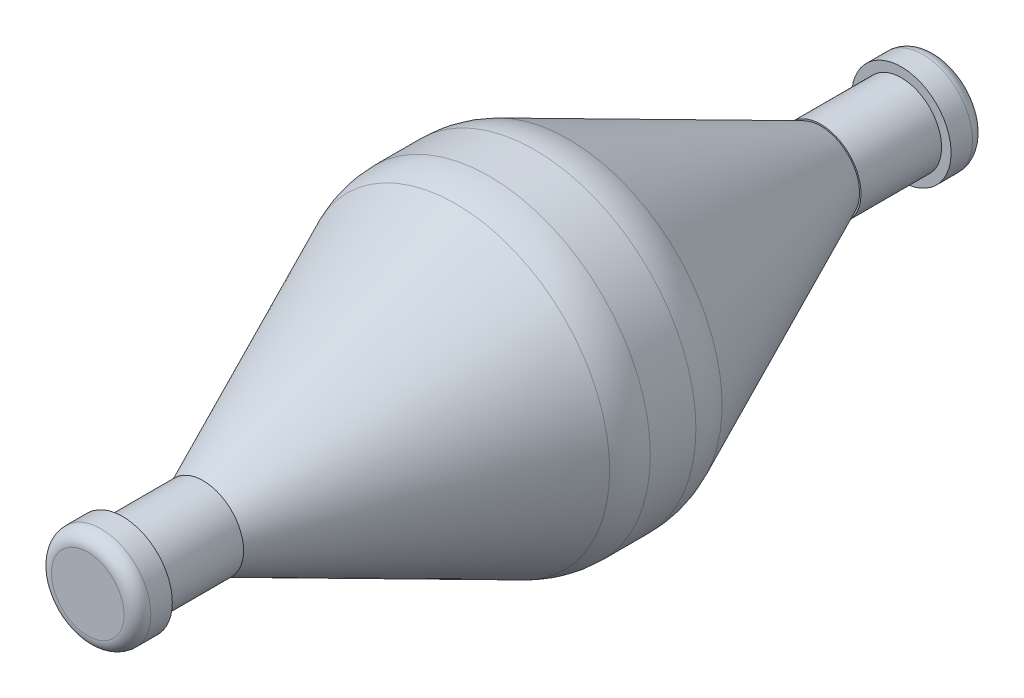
ISO-10303-21;
HEADER;
FILE_DESCRIPTION(('STEP AP214'),'2;1');
FILE_NAME('part.step','',(''),(''),'','','');
FILE_SCHEMA(('AUTOMOTIVE_DESIGN { 1 0 10303 214 1 1 1 1 }'));
ENDSEC;
DATA;
#1=APPLICATION_CONTEXT('core data for automotive mechanical design processes');
#2=APPLICATION_PROTOCOL_DEFINITION('international standard','automotive_design',2000,#1);
#3=PRODUCT_CONTEXT('',#1,'mechanical');
#4=PRODUCT('Part','Part','',(#3));
#5=PRODUCT_RELATED_PRODUCT_CATEGORY('part','',(#4));
#6=PRODUCT_DEFINITION_FORMATION('','',#4);
#7=PRODUCT_DEFINITION_CONTEXT('part definition',#1,'design');
#8=PRODUCT_DEFINITION('design','',#6,#7);
#9=PRODUCT_DEFINITION_SHAPE('','',#8);
#10=(LENGTH_UNIT() NAMED_UNIT(*) SI_UNIT(.MILLI.,.METRE.));
#11=(NAMED_UNIT(*) PLANE_ANGLE_UNIT() SI_UNIT($,.RADIAN.));
#12=(NAMED_UNIT(*) SI_UNIT($,.STERADIAN.) SOLID_ANGLE_UNIT());
#13=UNCERTAINTY_MEASURE_WITH_UNIT(LENGTH_MEASURE(1.E-05),#10,'distance_accuracy_value','');
#14=(GEOMETRIC_REPRESENTATION_CONTEXT(3) GLOBAL_UNCERTAINTY_ASSIGNED_CONTEXT((#13)) GLOBAL_UNIT_ASSIGNED_CONTEXT((#10,
#11,#12)) REPRESENTATION_CONTEXT('',''));
#15=CARTESIAN_POINT('',(0.,0.,0.));
#16=DIRECTION('',(0.,0.,1.));
#17=DIRECTION('',(1.,0.,0.));
#18=AXIS2_PLACEMENT_3D('',#15,#16,#17);
#19=CARTESIAN_POINT('',(0.,0.,1.5));
#20=DIRECTION('',(0.,0.,-1.));
#21=DIRECTION('',(-1.,0.,0.));
#22=AXIS2_PLACEMENT_3D('',#19,#20,#21);
#23=CYLINDRICAL_SURFACE('',#22,6.);
#24=CARTESIAN_POINT('',(0.,0.,0.848636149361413));
#25=DIRECTION('',(0.,0.,-1.));
#26=DIRECTION('',(-1.,0.,0.));
#27=AXIS2_PLACEMENT_3D('',#24,#25,#26);
#28=CIRCLE('',#27,6.);
#29=CARTESIAN_POINT('',(-6.,0.,0.848636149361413));
#30=VERTEX_POINT('',#29);
#31=EDGE_CURVE('E46',#30,#30,#28,.T.);
#32=ORIENTED_EDGE('',*,*,#31,.T.);
#33=EDGE_LOOP('',(#32));
#34=FACE_BOUND('',#33,.T.);
#35=CARTESIAN_POINT('',(0.,0.,-0.848636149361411));
#36=DIRECTION('',(0.,0.,1.));
#37=DIRECTION('',(1.,0.,0.));
#38=AXIS2_PLACEMENT_3D('',#35,#36,#37);
#39=CIRCLE('',#38,6.);
#40=CARTESIAN_POINT('',(6.,0.,-0.848636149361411));
#41=VERTEX_POINT('',#40);
#42=EDGE_CURVE('E49',#41,#41,#39,.T.);
#43=ORIENTED_EDGE('',*,*,#42,.T.);
#44=EDGE_LOOP('',(#43));
#45=FACE_BOUND('',#44,.T.);
#46=ADVANCED_FACE('F24',(#34,#45),#23,.T.);
#47=CARTESIAN_POINT('',(0.,0.,1.5));
#48=DIRECTION('',(0.,0.,-1.));
#49=DIRECTION('',(1.,0.,0.));
#50=AXIS2_PLACEMENT_3D('',#47,#48,#49);
#51=CONICAL_SURFACE('',#50,6.,0.427605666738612);
#52=CARTESIAN_POINT('',(0.,0.,2.09271587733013));
#53=DIRECTION('',(0.,0.,1.));
#54=DIRECTION('',(1.,0.,0.));
#55=AXIS2_PLACEMENT_3D('',#52,#53,#54);
#56=CIRCLE('',#55,5.72988381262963);
#57=CARTESIAN_POINT('',(5.72988381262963,0.,2.09271587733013));
#58=VERTEX_POINT('',#57);
#59=EDGE_CURVE('E52',#58,#58,#56,.T.);
#60=CARTESIAN_POINT('',(0.,0.,11.5));
#61=DIRECTION('',(0.,0.,1.));
#62=DIRECTION('',(1.,0.,0.));
#63=AXIS2_PLACEMENT_3D('',#60,#61,#62);
#64=CIRCLE('',#63,1.44273744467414);
#65=CARTESIAN_POINT('',(1.44273744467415,0.,11.5));
#66=VERTEX_POINT('',#65);
#67=EDGE_CURVE('E55',#66,#66,#64,.T.);
#68=CARTESIAN_POINT('',(5.72988381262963,0.,2.09271587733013));
#69=CARTESIAN_POINT('',(5.68522603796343,0.,2.19070842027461));
#70=CARTESIAN_POINT('',(5.64056826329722,0.,2.28870096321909));
#71=CARTESIAN_POINT('',(5.55125271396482,0.,2.48468604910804));
#72=CARTESIAN_POINT('',(5.50659493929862,0.,2.58267859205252));
#73=CARTESIAN_POINT('',(5.41727938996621,0.,2.77866367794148));
#74=CARTESIAN_POINT('',(5.37262161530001,0.,2.87665622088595));
#75=CARTESIAN_POINT('',(5.2833060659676,0.,3.07264130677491));
#76=CARTESIAN_POINT('',(5.2386482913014,0.,3.17063384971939));
#77=CARTESIAN_POINT('',(5.14933274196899,0.,3.36661893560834));
#78=CARTESIAN_POINT('',(5.10467496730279,0.,3.46461147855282));
#79=CARTESIAN_POINT('',(5.01535941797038,0.,3.66059656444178));
#80=CARTESIAN_POINT('',(4.97070164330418,0.,3.75858910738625));
#81=CARTESIAN_POINT('',(4.88138609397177,0.,3.95457419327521));
#82=CARTESIAN_POINT('',(4.83672831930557,0.,4.05256673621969));
#83=CARTESIAN_POINT('',(4.74741276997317,0.,4.24855182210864));
#84=CARTESIAN_POINT('',(4.70275499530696,0.,4.34654436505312));
#85=CARTESIAN_POINT('',(4.61343944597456,0.,4.54252945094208));
#86=CARTESIAN_POINT('',(4.56878167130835,0.,4.64052199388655));
#87=CARTESIAN_POINT('',(4.47946612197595,0.,4.83650707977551));
#88=CARTESIAN_POINT('',(4.43480834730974,0.,4.93449962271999));
#89=CARTESIAN_POINT('',(4.34549279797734,0.,5.13048470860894));
#90=CARTESIAN_POINT('',(4.30083502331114,0.,5.22847725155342));
#91=CARTESIAN_POINT('',(4.21151947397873,0.,5.42446233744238));
#92=CARTESIAN_POINT('',(4.16686169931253,0.,5.52245488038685));
#93=CARTESIAN_POINT('',(4.07754614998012,0.,5.71843996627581));
#94=CARTESIAN_POINT('',(4.03288837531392,0.,5.81643250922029));
#95=CARTESIAN_POINT('',(3.94357282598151,0.,6.01241759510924));
#96=CARTESIAN_POINT('',(3.89891505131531,0.,6.11041013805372));
#97=CARTESIAN_POINT('',(3.8095995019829,0.,6.30639522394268));
#98=CARTESIAN_POINT('',(3.7649417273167,0.,6.40438776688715));
#99=CARTESIAN_POINT('',(3.67562617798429,0.,6.60037285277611));
#100=CARTESIAN_POINT('',(3.63096840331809,0.,6.69836539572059));
#101=CARTESIAN_POINT('',(3.54165285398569,0.,6.89435048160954));
#102=CARTESIAN_POINT('',(3.49699507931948,0.,6.99234302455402));
#103=CARTESIAN_POINT('',(3.40767952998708,0.,7.18832811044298));
#104=CARTESIAN_POINT('',(3.36302175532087,0.,7.28632065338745));
#105=CARTESIAN_POINT('',(3.27370620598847,0.,7.48230573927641));
#106=CARTESIAN_POINT('',(3.22904843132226,0.,7.58029828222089));
#107=CARTESIAN_POINT('',(3.13973288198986,0.,7.77628336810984));
#108=CARTESIAN_POINT('',(3.09507510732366,0.,7.87427591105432));
#109=CARTESIAN_POINT('',(3.00575955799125,0.,8.07026099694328));
#110=CARTESIAN_POINT('',(2.96110178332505,0.,8.16825353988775));
#111=CARTESIAN_POINT('',(2.87178623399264,0.,8.36423862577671));
#112=CARTESIAN_POINT('',(2.82712845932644,0.,8.46223116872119));
#113=CARTESIAN_POINT('',(2.73781290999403,0.,8.65821625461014));
#114=CARTESIAN_POINT('',(2.69315513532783,0.,8.75620879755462));
#115=CARTESIAN_POINT('',(2.60383958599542,0.,8.95219388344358));
#116=CARTESIAN_POINT('',(2.55918181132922,0.,9.05018642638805));
#117=CARTESIAN_POINT('',(2.46986626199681,0.,9.24617151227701));
#118=CARTESIAN_POINT('',(2.42520848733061,0.,9.34416405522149));
#119=CARTESIAN_POINT('',(2.33589293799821,0.,9.54014914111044));
#120=CARTESIAN_POINT('',(2.291235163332,0.,9.63814168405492));
#121=CARTESIAN_POINT('',(2.2019196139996,0.,9.83412676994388));
#122=CARTESIAN_POINT('',(2.15726183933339,0.,9.93211931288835));
#123=CARTESIAN_POINT('',(2.06794629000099,0.,10.1281043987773));
#124=CARTESIAN_POINT('',(2.02328851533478,0.,10.2260969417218));
#125=CARTESIAN_POINT('',(1.93397296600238,0.,10.4220820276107));
#126=CARTESIAN_POINT('',(1.88931519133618,0.,10.5200745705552));
#127=CARTESIAN_POINT('',(1.79999964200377,0.,10.7160596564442));
#128=CARTESIAN_POINT('',(1.75534186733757,0.,10.8140521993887));
#129=CARTESIAN_POINT('',(1.66602631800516,0.,11.0100372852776));
#130=CARTESIAN_POINT('',(1.62136854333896,0.,11.1080298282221));
#131=CARTESIAN_POINT('',(1.53205299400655,0.,11.304014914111));
#132=CARTESIAN_POINT('',(1.48739521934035,0.,11.4020074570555));
#133=CARTESIAN_POINT('',(1.44273744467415,0.,11.5));
#134=B_SPLINE_CURVE_WITH_KNOTS('',3,(#68,#69,#70,#71,#72,#73,#74,#75,#76,#77,#78,#79,#80,#81,
#82,#83,#84,#85,#86,#87,#88,#89,#90,#91,#92,#93,#94,#95,#96,#97,#98,#99,#100,#101,#102,#103,
#104,#105,#106,#107,#108,#109,#110,#111,#112,#113,#114,#115,#116,#117,#118,#119,#120,#121,#122,
#123,#124,#125,#126,#127,#128,#129,#130,#131,#132,#133),.UNSPECIFIED.,.F.,.F.,(4,2,2,2,2,2,2,2,
2,2,2,2,2,2,2,2,2,2,2,2,2,2,2,2,2,2,2,2,2,2,2,2,4),(0.,0.323066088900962,0.646132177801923,
0.969198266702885,1.29226435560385,1.61533044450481,1.93839653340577,2.26146262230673,
2.58452871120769,2.90759480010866,3.23066088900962,3.55372697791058,3.87679306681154,
4.1998591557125,4.52292524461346,4.84599133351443,5.16905742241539,5.49212351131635,
5.81518960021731,6.13825568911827,6.46132177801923,6.7843878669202,7.10745395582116,
7.43052004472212,7.75358613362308,8.07665222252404,8.399718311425,8.72278440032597,
9.04585048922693,9.36891657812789,9.69198266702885,10.0150487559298,10.3381148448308),.UNSPECIFIED.);
#135=EDGE_CURVE('BSEAM104',#58,#66,#134,.T.);
#136=ORIENTED_EDGE('',*,*,#59,.T.);
#137=ORIENTED_EDGE('',*,*,#67,.F.);
#138=ORIENTED_EDGE('',*,*,#135,.T.);
#139=ORIENTED_EDGE('',*,*,#135,.F.);
#140=EDGE_LOOP('',(#136,#138,#137,#139));
#141=FACE_BOUND('',#140,.T.);
#142=ADVANCED_FACE('F104',(#141),#51,.T.);
#143=CARTESIAN_POINT('',(0.,0.,-1.5));
#144=DIRECTION('',(0.,0.,1.));
#145=DIRECTION('',(-1.,0.,0.));
#146=AXIS2_PLACEMENT_3D('',#143,#144,#145);
#147=CONICAL_SURFACE('',#146,6.,0.427605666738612);
#148=CARTESIAN_POINT('',(0.,0.,-2.09271587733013));
#149=DIRECTION('',(0.,0.,-1.));
#150=DIRECTION('',(-1.,0.,0.));
#151=AXIS2_PLACEMENT_3D('',#148,#149,#150);
#152=CIRCLE('',#151,5.72988381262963);
#153=CARTESIAN_POINT('',(-5.72988381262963,0.,-2.09271587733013));
#154=VERTEX_POINT('',#153);
#155=EDGE_CURVE('E43',#154,#154,#152,.T.);
#156=CARTESIAN_POINT('',(0.,0.,-11.5));
#157=DIRECTION('',(0.,0.,-1.));
#158=DIRECTION('',(-1.,0.,0.));
#159=AXIS2_PLACEMENT_3D('',#156,#157,#158);
#160=CIRCLE('',#159,1.44273744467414);
#161=CARTESIAN_POINT('',(-1.44273744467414,0.,-11.5));
#162=VERTEX_POINT('',#161);
#163=EDGE_CURVE('E58',#162,#162,#160,.T.);
#164=CARTESIAN_POINT('',(-5.72988381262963,0.,-2.09271587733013));
#165=CARTESIAN_POINT('',(-5.68522603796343,0.,-2.19070842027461));
#166=CARTESIAN_POINT('',(-5.64056826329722,0.,-2.28870096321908));
#167=CARTESIAN_POINT('',(-5.55125271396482,0.,-2.48468604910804));
#168=CARTESIAN_POINT('',(-5.50659493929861,0.,-2.58267859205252));
#169=CARTESIAN_POINT('',(-5.41727938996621,0.,-2.77866367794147));
#170=CARTESIAN_POINT('',(-5.37262161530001,0.,-2.87665622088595));
#171=CARTESIAN_POINT('',(-5.2833060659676,0.,-3.07264130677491));
#172=CARTESIAN_POINT('',(-5.2386482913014,0.,-3.17063384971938));
#173=CARTESIAN_POINT('',(-5.14933274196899,0.,-3.36661893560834));
#174=CARTESIAN_POINT('',(-5.10467496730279,0.,-3.46461147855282));
#175=CARTESIAN_POINT('',(-5.01535941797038,0.,-3.66059656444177));
#176=CARTESIAN_POINT('',(-4.97070164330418,0.,-3.75858910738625));
#177=CARTESIAN_POINT('',(-4.88138609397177,0.,-3.95457419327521));
#178=CARTESIAN_POINT('',(-4.83672831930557,0.,-4.05256673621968));
#179=CARTESIAN_POINT('',(-4.74741276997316,0.,-4.24855182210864));
#180=CARTESIAN_POINT('',(-4.70275499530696,0.,-4.34654436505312));
#181=CARTESIAN_POINT('',(-4.61343944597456,0.,-4.54252945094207));
#182=CARTESIAN_POINT('',(-4.56878167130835,0.,-4.64052199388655));
#183=CARTESIAN_POINT('',(-4.47946612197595,0.,-4.83650707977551));
#184=CARTESIAN_POINT('',(-4.43480834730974,0.,-4.93449962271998));
#185=CARTESIAN_POINT('',(-4.34549279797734,0.,-5.13048470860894));
#186=CARTESIAN_POINT('',(-4.30083502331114,0.,-5.22847725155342));
#187=CARTESIAN_POINT('',(-4.21151947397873,0.,-5.42446233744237));
#188=CARTESIAN_POINT('',(-4.16686169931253,0.,-5.52245488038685));
#189=CARTESIAN_POINT('',(-4.07754614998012,0.,-5.71843996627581));
#190=CARTESIAN_POINT('',(-4.03288837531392,0.,-5.81643250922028));
#191=CARTESIAN_POINT('',(-3.94357282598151,0.,-6.01241759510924));
#192=CARTESIAN_POINT('',(-3.89891505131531,0.,-6.11041013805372));
#193=CARTESIAN_POINT('',(-3.8095995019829,0.,-6.30639522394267));
#194=CARTESIAN_POINT('',(-3.7649417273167,0.,-6.40438776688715));
#195=CARTESIAN_POINT('',(-3.67562617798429,0.,-6.60037285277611));
#196=CARTESIAN_POINT('',(-3.63096840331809,0.,-6.69836539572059));
#197=CARTESIAN_POINT('',(-3.54165285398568,0.,-6.89435048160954));
#198=CARTESIAN_POINT('',(-3.49699507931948,0.,-6.99234302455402));
#199=CARTESIAN_POINT('',(-3.40767952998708,0.,-7.18832811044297));
#200=CARTESIAN_POINT('',(-3.36302175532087,0.,-7.28632065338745));
#201=CARTESIAN_POINT('',(-3.27370620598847,0.,-7.48230573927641));
#202=CARTESIAN_POINT('',(-3.22904843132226,0.,-7.58029828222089));
#203=CARTESIAN_POINT('',(-3.13973288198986,0.,-7.77628336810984));
#204=CARTESIAN_POINT('',(-3.09507510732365,0.,-7.87427591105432));
#205=CARTESIAN_POINT('',(-3.00575955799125,0.,-8.07026099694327));
#206=CARTESIAN_POINT('',(-2.96110178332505,0.,-8.16825353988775));
#207=CARTESIAN_POINT('',(-2.87178623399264,0.,-8.36423862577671));
#208=CARTESIAN_POINT('',(-2.82712845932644,0.,-8.46223116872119));
#209=CARTESIAN_POINT('',(-2.73781290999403,0.,-8.65821625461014));
#210=CARTESIAN_POINT('',(-2.69315513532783,0.,-8.75620879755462));
#211=CARTESIAN_POINT('',(-2.60383958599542,0.,-8.95219388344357));
#212=CARTESIAN_POINT('',(-2.55918181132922,0.,-9.05018642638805));
#213=CARTESIAN_POINT('',(-2.46986626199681,0.,-9.24617151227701));
#214=CARTESIAN_POINT('',(-2.42520848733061,0.,-9.34416405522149));
#215=CARTESIAN_POINT('',(-2.3358929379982,0.,-9.54014914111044));
#216=CARTESIAN_POINT('',(-2.291235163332,0.,-9.63814168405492));
#217=CARTESIAN_POINT('',(-2.20191961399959,0.,-9.83412676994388));
#218=CARTESIAN_POINT('',(-2.15726183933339,0.,-9.93211931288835));
#219=CARTESIAN_POINT('',(-2.06794629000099,0.,-10.1281043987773));
#220=CARTESIAN_POINT('',(-2.02328851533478,0.,-10.2260969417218));
#221=CARTESIAN_POINT('',(-1.93397296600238,0.,-10.4220820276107));
#222=CARTESIAN_POINT('',(-1.88931519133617,0.,-10.5200745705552));
#223=CARTESIAN_POINT('',(-1.79999964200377,0.,-10.7160596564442));
#224=CARTESIAN_POINT('',(-1.75534186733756,0.,-10.8140521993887));
#225=CARTESIAN_POINT('',(-1.66602631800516,0.,-11.0100372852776));
#226=CARTESIAN_POINT('',(-1.62136854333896,0.,-11.1080298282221));
#227=CARTESIAN_POINT('',(-1.53205299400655,0.,-11.304014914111));
#228=CARTESIAN_POINT('',(-1.48739521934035,0.,-11.4020074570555));
#229=CARTESIAN_POINT('',(-1.44273744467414,0.,-11.5));
#230=B_SPLINE_CURVE_WITH_KNOTS('',3,(#164,#165,#166,#167,#168,#169,#170,#171,#172,#173,#174,
#175,#176,#177,#178,#179,#180,#181,#182,#183,#184,#185,#186,#187,#188,#189,#190,#191,#192,#193,
#194,#195,#196,#197,#198,#199,#200,#201,#202,#203,#204,#205,#206,#207,#208,#209,#210,#211,#212,
#213,#214,#215,#216,#217,#218,#219,#220,#221,#222,#223,#224,#225,#226,#227,#228,#229),
.UNSPECIFIED.,.F.,.F.,(4,2,2,2,2,2,2,2,2,2,2,2,2,2,2,2,2,2,2,2,2,2,2,2,2,2,2,2,2,2,2,2,4),(0.,
0.323066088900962,0.646132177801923,0.969198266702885,1.29226435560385,1.61533044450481,
1.93839653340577,2.26146262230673,2.58452871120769,2.90759480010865,3.23066088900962,
3.55372697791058,3.87679306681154,4.1998591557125,4.52292524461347,4.84599133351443,
5.16905742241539,5.49212351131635,5.81518960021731,6.13825568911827,6.46132177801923,
6.7843878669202,7.10745395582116,7.43052004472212,7.75358613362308,8.07665222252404,
8.39971831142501,8.72278440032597,9.04585048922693,9.36891657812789,9.69198266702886,
10.0150487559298,10.3381148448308),.UNSPECIFIED.);
#231=EDGE_CURVE('BSEAM99',#154,#162,#230,.T.);
#232=ORIENTED_EDGE('',*,*,#155,.T.);
#233=ORIENTED_EDGE('',*,*,#163,.F.);
#234=ORIENTED_EDGE('',*,*,#231,.T.);
#235=ORIENTED_EDGE('',*,*,#231,.F.);
#236=EDGE_LOOP('',(#232,#234,#233,#235));
#237=FACE_BOUND('',#236,.T.);
#238=ADVANCED_FACE('F99',(#237),#147,.T.);
#239=CARTESIAN_POINT('',(0.,0.,-11.5));
#240=DIRECTION('',(0.,0.,-1.));
#241=DIRECTION('',(-1.,0.,0.));
#242=AXIS2_PLACEMENT_3D('',#239,#240,#241);
#243=PLANE('',#242);
#244=CARTESIAN_POINT('',(0.,0.,-11.5));
#245=DIRECTION('',(0.,0.,-1.));
#246=DIRECTION('',(-1.,0.,0.));
#247=AXIS2_PLACEMENT_3D('',#244,#245,#246);
#248=CIRCLE('',#247,1.49797977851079);
#249=CARTESIAN_POINT('',(-1.49797977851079,0.,-11.5));
#250=VERTEX_POINT('',#249);
#251=EDGE_CURVE('E64',#250,#250,#248,.T.);
#252=ORIENTED_EDGE('',*,*,#251,.F.);
#253=EDGE_LOOP('',(#252));
#254=FACE_BOUND('',#253,.T.);
#255=ORIENTED_EDGE('',*,*,#163,.T.);
#256=EDGE_LOOP('',(#255));
#257=FACE_BOUND('',#256,.T.);
#258=ADVANCED_FACE('F93',(#254,#257),#243,.F.);
#259=CARTESIAN_POINT('',(0.,0.,-14.5));
#260=DIRECTION('',(0.,0.,1.));
#261=DIRECTION('',(1.,0.,0.));
#262=AXIS2_PLACEMENT_3D('',#259,#260,#261);
#263=CYLINDRICAL_SURFACE('',#262,1.49797977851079);
#264=CARTESIAN_POINT('',(0.,0.,-14.5));
#265=DIRECTION('',(0.,0.,-1.));
#266=DIRECTION('',(-1.,0.,0.));
#267=AXIS2_PLACEMENT_3D('',#264,#265,#266);
#268=CIRCLE('',#267,1.49797977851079);
#269=CARTESIAN_POINT('',(-1.49797977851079,0.,-14.5));
#270=VERTEX_POINT('',#269);
#271=EDGE_CURVE('E61',#270,#270,#268,.T.);
#272=ORIENTED_EDGE('',*,*,#271,.F.);
#273=EDGE_LOOP('',(#272));
#274=FACE_BOUND('',#273,.T.);
#275=ORIENTED_EDGE('',*,*,#251,.T.);
#276=EDGE_LOOP('',(#275));
#277=FACE_BOUND('',#276,.T.);
#278=ADVANCED_FACE('F89',(#274,#277),#263,.T.);
#279=CARTESIAN_POINT('',(0.,0.,11.5));
#280=DIRECTION('',(0.,0.,1.));
#281=DIRECTION('',(1.,0.,0.));
#282=AXIS2_PLACEMENT_3D('',#279,#280,#281);
#283=PLANE('',#282);
#284=CARTESIAN_POINT('',(0.,0.,11.5));
#285=DIRECTION('',(0.,0.,1.));
#286=DIRECTION('',(1.,0.,0.));
#287=AXIS2_PLACEMENT_3D('',#284,#285,#286);
#288=CIRCLE('',#287,1.504);
#289=CARTESIAN_POINT('',(1.504,0.,11.5));
#290=VERTEX_POINT('',#289);
#291=EDGE_CURVE('E70',#290,#290,#288,.T.);
#292=ORIENTED_EDGE('',*,*,#291,.F.);
#293=EDGE_LOOP('',(#292));
#294=FACE_BOUND('',#293,.T.);
#295=ORIENTED_EDGE('',*,*,#67,.T.);
#296=EDGE_LOOP('',(#295));
#297=FACE_BOUND('',#296,.T.);
#298=ADVANCED_FACE('F92',(#294,#297),#283,.F.);
#299=CARTESIAN_POINT('',(0.,0.,14.5));
#300=DIRECTION('',(0.,0.,-1.));
#301=DIRECTION('',(-1.,0.,0.));
#302=AXIS2_PLACEMENT_3D('',#299,#300,#301);
#303=CYLINDRICAL_SURFACE('',#302,1.504);
#304=CARTESIAN_POINT('',(0.,0.,14.5));
#305=DIRECTION('',(0.,0.,1.));
#306=DIRECTION('',(1.,0.,0.));
#307=AXIS2_PLACEMENT_3D('',#304,#305,#306);
#308=CIRCLE('',#307,1.504);
#309=CARTESIAN_POINT('',(1.504,0.,14.5));
#310=VERTEX_POINT('',#309);
#311=EDGE_CURVE('E67',#310,#310,#308,.T.);
#312=ORIENTED_EDGE('',*,*,#311,.F.);
#313=EDGE_LOOP('',(#312));
#314=FACE_BOUND('',#313,.T.);
#315=ORIENTED_EDGE('',*,*,#291,.T.);
#316=EDGE_LOOP('',(#315));
#317=FACE_BOUND('',#316,.T.);
#318=ADVANCED_FACE('F149',(#314,#317),#303,.T.);
#319=CARTESIAN_POINT('',(0.,0.,14.5));
#320=DIRECTION('',(0.,0.,1.));
#321=DIRECTION('',(1.,0.,0.));
#322=AXIS2_PLACEMENT_3D('',#319,#320,#321);
#323=PLANE('',#322);
#324=CARTESIAN_POINT('',(0.,0.,14.5));
#325=DIRECTION('',(0.,0.,1.));
#326=DIRECTION('',(1.,0.,0.));
#327=AXIS2_PLACEMENT_3D('',#324,#325,#326);
#328=CIRCLE('',#327,1.85);
#329=CARTESIAN_POINT('',(1.85,0.,14.5));
#330=VERTEX_POINT('',#329);
#331=EDGE_CURVE('E73',#330,#330,#328,.T.);
#332=ORIENTED_EDGE('',*,*,#331,.F.);
#333=EDGE_LOOP('',(#332));
#334=FACE_BOUND('',#333,.T.);
#335=ORIENTED_EDGE('',*,*,#311,.T.);
#336=EDGE_LOOP('',(#335));
#337=FACE_BOUND('',#336,.T.);
#338=ADVANCED_FACE('F145',(#334,#337),#323,.F.);
#339=CARTESIAN_POINT('',(0.,0.,15.8));
#340=DIRECTION('',(0.,0.,-1.));
#341=DIRECTION('',(-1.,0.,0.));
#342=AXIS2_PLACEMENT_3D('',#339,#340,#341);
#343=CYLINDRICAL_SURFACE('',#342,1.85);
#344=CARTESIAN_POINT('',(0.,0.,15.3));
#345=DIRECTION('',(0.,0.,1.));
#346=DIRECTION('',(1.,0.,0.));
#347=AXIS2_PLACEMENT_3D('',#344,#345,#346);
#348=CIRCLE('',#347,1.85);
#349=CARTESIAN_POINT('',(1.85,0.,15.3));
#350=VERTEX_POINT('',#349);
#351=EDGE_CURVE('E10',#350,#350,#348,.F.);
#352=ORIENTED_EDGE('',*,*,#351,.T.);
#353=EDGE_LOOP('',(#352));
#354=FACE_BOUND('',#353,.T.);
#355=ORIENTED_EDGE('',*,*,#331,.T.);
#356=EDGE_LOOP('',(#355));
#357=FACE_BOUND('',#356,.T.);
#358=ADVANCED_FACE('F148',(#354,#357),#343,.T.);
#359=CARTESIAN_POINT('',(0.,0.,15.8));
#360=DIRECTION('',(0.,0.,1.));
#361=DIRECTION('',(1.,0.,0.));
#362=AXIS2_PLACEMENT_3D('',#359,#360,#361);
#363=PLANE('',#362);
#364=CARTESIAN_POINT('',(0.,0.,15.8));
#365=DIRECTION('',(0.,0.,1.));
#366=DIRECTION('',(1.,0.,0.));
#367=AXIS2_PLACEMENT_3D('',#364,#365,#366);
#368=CIRCLE('',#367,1.35);
#369=CARTESIAN_POINT('',(1.35,0.,15.8));
#370=VERTEX_POINT('',#369);
#371=EDGE_CURVE('E30',#370,#370,#368,.T.);
#372=ORIENTED_EDGE('',*,*,#371,.T.);
#373=EDGE_LOOP('',(#372));
#374=FACE_BOUND('',#373,.T.);
#375=ADVANCED_FACE('F85',(#374),#363,.T.);
#376=CARTESIAN_POINT('',(0.,0.,-14.5));
#377=DIRECTION('',(0.,0.,-1.));
#378=DIRECTION('',(-1.,0.,0.));
#379=AXIS2_PLACEMENT_3D('',#376,#377,#378);
#380=PLANE('',#379);
#381=CARTESIAN_POINT('',(0.,0.,-14.5));
#382=DIRECTION('',(0.,0.,-1.));
#383=DIRECTION('',(-1.,0.,0.));
#384=AXIS2_PLACEMENT_3D('',#381,#382,#383);
#385=CIRCLE('',#384,1.85);
#386=CARTESIAN_POINT('',(-1.85,0.,-14.5));
#387=VERTEX_POINT('',#386);
#388=EDGE_CURVE('E76',#387,#387,#385,.T.);
#389=ORIENTED_EDGE('',*,*,#388,.F.);
#390=EDGE_LOOP('',(#389));
#391=FACE_BOUND('',#390,.T.);
#392=ORIENTED_EDGE('',*,*,#271,.T.);
#393=EDGE_LOOP('',(#392));
#394=FACE_BOUND('',#393,.T.);
#395=ADVANCED_FACE('F82',(#391,#394),#380,.F.);
#396=CARTESIAN_POINT('',(0.,0.,-15.8));
#397=DIRECTION('',(0.,0.,1.));
#398=DIRECTION('',(1.,0.,0.));
#399=AXIS2_PLACEMENT_3D('',#396,#397,#398);
#400=CYLINDRICAL_SURFACE('',#399,1.85);
#401=CARTESIAN_POINT('',(0.,0.,-15.3));
#402=DIRECTION('',(0.,0.,-1.));
#403=DIRECTION('',(-1.,0.,0.));
#404=AXIS2_PLACEMENT_3D('',#401,#402,#403);
#405=CIRCLE('',#404,1.85);
#406=CARTESIAN_POINT('',(-1.85,0.,-15.3));
#407=VERTEX_POINT('',#406);
#408=EDGE_CURVE('E34',#407,#407,#405,.F.);
#409=ORIENTED_EDGE('',*,*,#408,.T.);
#410=EDGE_LOOP('',(#409));
#411=FACE_BOUND('',#410,.T.);
#412=ORIENTED_EDGE('',*,*,#388,.T.);
#413=EDGE_LOOP('',(#412));
#414=FACE_BOUND('',#413,.T.);
#415=ADVANCED_FACE('F80',(#411,#414),#400,.T.);
#416=CARTESIAN_POINT('',(0.,0.,-15.8));
#417=DIRECTION('',(0.,0.,-1.));
#418=DIRECTION('',(-1.,0.,0.));
#419=AXIS2_PLACEMENT_3D('',#416,#417,#418);
#420=PLANE('',#419);
#421=CARTESIAN_POINT('',(0.,0.,-15.8));
#422=DIRECTION('',(0.,0.,-1.));
#423=DIRECTION('',(-1.,0.,0.));
#424=AXIS2_PLACEMENT_3D('',#421,#422,#423);
#425=CIRCLE('',#424,1.35);
#426=CARTESIAN_POINT('',(-1.35,0.,-15.8));
#427=VERTEX_POINT('',#426);
#428=EDGE_CURVE('E38',#427,#427,#425,.T.);
#429=ORIENTED_EDGE('',*,*,#428,.T.);
#430=EDGE_LOOP('',(#429));
#431=FACE_BOUND('',#430,.T.);
#432=ADVANCED_FACE('F134',(#431),#420,.T.);
#433=CARTESIAN_POINT('',(0.,0.,0.848636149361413));
#434=DIRECTION('',(0.,0.,-1.));
#435=DIRECTION('',(-1.,0.,0.));
#436=AXIS2_PLACEMENT_3D('',#433,#434,#435);
#437=TOROIDAL_SURFACE('',#436,3.,3.);
#438=ORIENTED_EDGE('',*,*,#31,.F.);
#439=EDGE_LOOP('',(#438));
#440=FACE_BOUND('',#439,.T.);
#441=ORIENTED_EDGE('',*,*,#59,.F.);
#442=EDGE_LOOP('',(#441));
#443=FACE_BOUND('',#442,.T.);
#444=ADVANCED_FACE('F124',(#440,#443),#437,.T.);
#445=CARTESIAN_POINT('',(0.,0.,-0.84863614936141));
#446=DIRECTION('',(0.,0.,1.));
#447=DIRECTION('',(1.,0.,0.));
#448=AXIS2_PLACEMENT_3D('',#445,#446,#447);
#449=TOROIDAL_SURFACE('',#448,3.,3.);
#450=ORIENTED_EDGE('',*,*,#42,.F.);
#451=EDGE_LOOP('',(#450));
#452=FACE_BOUND('',#451,.T.);
#453=ORIENTED_EDGE('',*,*,#155,.F.);
#454=EDGE_LOOP('',(#453));
#455=FACE_BOUND('',#454,.T.);
#456=ADVANCED_FACE('F120',(#452,#455),#449,.T.);
#457=CARTESIAN_POINT('',(0.,0.,-15.3));
#458=DIRECTION('',(0.,0.,-1.));
#459=DIRECTION('',(-1.,0.,0.));
#460=AXIS2_PLACEMENT_3D('',#457,#458,#459);
#461=TOROIDAL_SURFACE('',#460,1.35,0.5);
#462=ORIENTED_EDGE('',*,*,#408,.F.);
#463=EDGE_LOOP('',(#462));
#464=FACE_BOUND('',#463,.T.);
#465=ORIENTED_EDGE('',*,*,#428,.F.);
#466=EDGE_LOOP('',(#465));
#467=FACE_BOUND('',#466,.T.);
#468=ADVANCED_FACE('F123',(#464,#467),#461,.T.);
#469=CARTESIAN_POINT('',(0.,0.,15.3));
#470=DIRECTION('',(0.,0.,1.));
#471=DIRECTION('',(1.,0.,0.));
#472=AXIS2_PLACEMENT_3D('',#469,#470,#471);
#473=TOROIDAL_SURFACE('',#472,1.35,0.5);
#474=ORIENTED_EDGE('',*,*,#351,.F.);
#475=EDGE_LOOP('',(#474));
#476=FACE_BOUND('',#475,.T.);
#477=ORIENTED_EDGE('',*,*,#371,.F.);
#478=EDGE_LOOP('',(#477));
#479=FACE_BOUND('',#478,.T.);
#480=ADVANCED_FACE('F131',(#476,#479),#473,.T.);
#481=CLOSED_SHELL('',(#46,#142,#238,#258,#278,#298,#318,#338,#358,#375,#395,#415,#432,#444,#456,
#468,#480));
#482=MANIFOLD_SOLID_BREP('B2',#481);
#483=ADVANCED_BREP_SHAPE_REPRESENTATION('',(#18,#482),#14);
#484=SHAPE_DEFINITION_REPRESENTATION(#9,#483);
ENDSEC;
END-ISO-10303-21;
